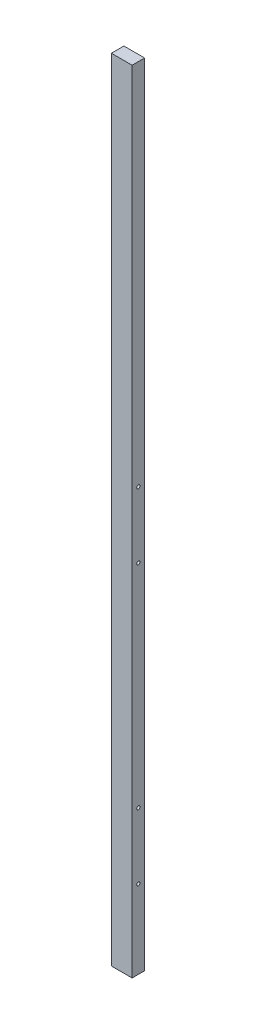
from build123d import *

# Parameters (mm, degrees)
SKETCH1_W           = 63
SKETCH1_H           = 2400
BOSS_EXTRUDE1_DEPTH = 38
CUT_EXTRUDE1_REACH  = 2403.127
SKETCH2_R           = 5


with BuildPart() as part:
    # Sketch1 → Boss-Extrude1 (new body)
    with BuildSketch(Plane.XY):
        with Locations((31.5, 1200)):
            Rectangle(SKETCH1_W, SKETCH1_H)
    extrude(amount=BOSS_EXTRUDE1_DEPTH)

    # Sketch2 → Cut-Extrude1 (cut, up to next)
    with BuildSketch(Plane(origin=(63, 0, 0), x_dir=(0, 0, -1), z_dir=(1, 0, 0)), mode=Mode.PRIVATE) as cut_extrude1_sk1:
        with Locations((-19, 238)):
            Circle(SKETCH2_R)
    cut_extrude1_tool1 = extrude(cut_extrude1_sk1.sketch, amount=-CUT_EXTRUDE1_REACH, mode=Mode.PRIVATE) & part.part
    # Sketch2 → Cut-Extrude1 (cut, up to next)
    with BuildSketch(Plane(origin=(63, 0, 0), x_dir=(0, 0, -1), z_dir=(1, 0, 0)), mode=Mode.PRIVATE) as cut_extrude1_sk2:
        with Locations((-19, 438)):
            Circle(SKETCH2_R)
    cut_extrude1_tool2 = extrude(cut_extrude1_sk2.sketch, amount=-CUT_EXTRUDE1_REACH, mode=Mode.PRIVATE) & part.part
    # Sketch2 → Cut-Extrude1 (cut, up to next)
    with BuildSketch(Plane(origin=(63, 0, 0), x_dir=(0, 0, -1), z_dir=(1, 0, 0)), mode=Mode.PRIVATE) as cut_extrude1_sk3:
        with Locations((-19, 1082)):
            Circle(SKETCH2_R)
    cut_extrude1_tool3 = extrude(cut_extrude1_sk3.sketch, amount=-CUT_EXTRUDE1_REACH, mode=Mode.PRIVATE) & part.part
    # Sketch2 → Cut-Extrude1 (cut, up to next)
    with BuildSketch(Plane(origin=(63, 0, 0), x_dir=(0, 0, -1), z_dir=(1, 0, 0)), mode=Mode.PRIVATE) as cut_extrude1_sk4:
        with Locations((-19, 1282)):
            Circle(SKETCH2_R)
    cut_extrude1_tool4 = extrude(cut_extrude1_sk4.sketch, amount=-CUT_EXTRUDE1_REACH, mode=Mode.PRIVATE) & part.part
    add(cut_extrude1_tool1.solids().sort_by_distance((63, 238, 19))[0], mode=Mode.SUBTRACT)
    add(cut_extrude1_tool2.solids().sort_by_distance((63, 438, 19))[0], mode=Mode.SUBTRACT)
    add(cut_extrude1_tool3.solids().sort_by_distance((63, 1082, 19))[0], mode=Mode.SUBTRACT)
    add(cut_extrude1_tool4.solids().sort_by_distance((63, 1282, 19))[0], mode=Mode.SUBTRACT)


solid = part.part
